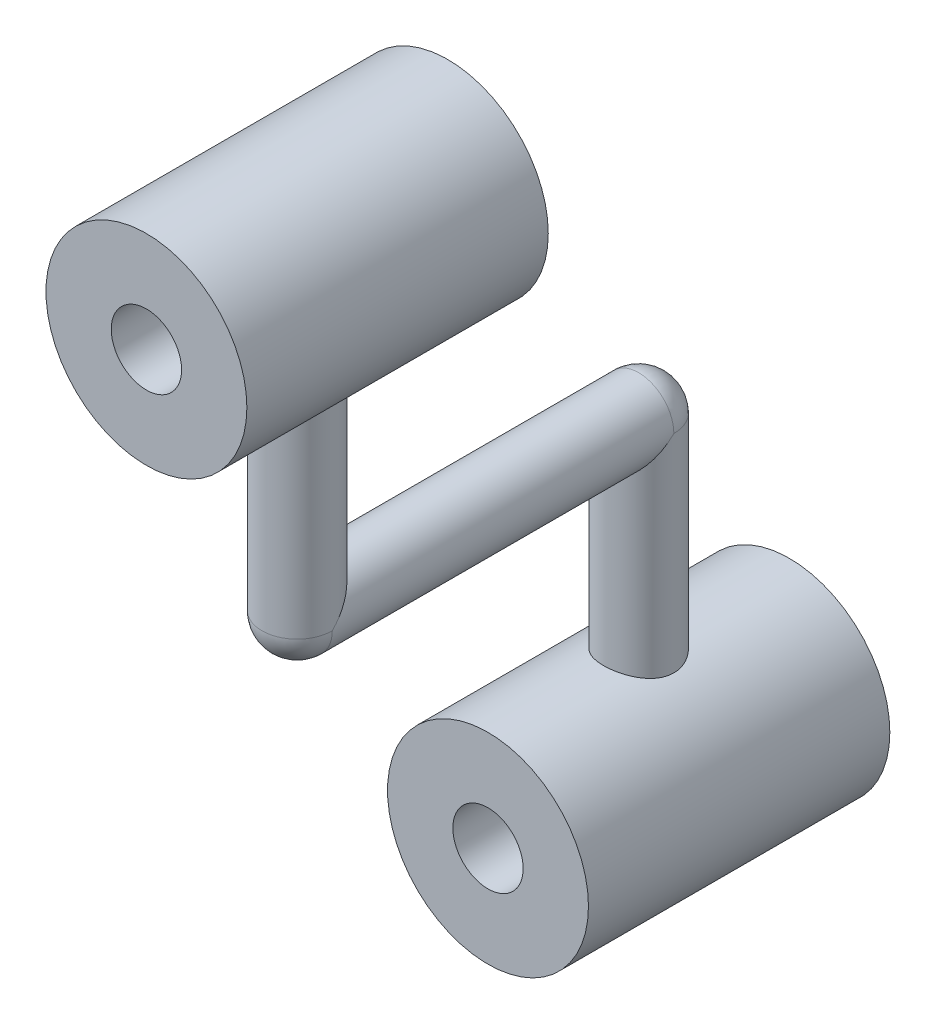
ISO-10303-21;
HEADER;
FILE_DESCRIPTION(('STEP AP214'),'2;1');
FILE_NAME('part.step','',(''),(''),'','','');
FILE_SCHEMA(('AUTOMOTIVE_DESIGN { 1 0 10303 214 1 1 1 1 }'));
ENDSEC;
DATA;
#1=APPLICATION_CONTEXT('core data for automotive mechanical design processes');
#2=APPLICATION_PROTOCOL_DEFINITION('international standard','automotive_design',2000,#1);
#3=PRODUCT_CONTEXT('',#1,'mechanical');
#4=PRODUCT('Part','Part','',(#3));
#5=PRODUCT_RELATED_PRODUCT_CATEGORY('part','',(#4));
#6=PRODUCT_DEFINITION_FORMATION('','',#4);
#7=PRODUCT_DEFINITION_CONTEXT('part definition',#1,'design');
#8=PRODUCT_DEFINITION('design','',#6,#7);
#9=PRODUCT_DEFINITION_SHAPE('','',#8);
#10=(LENGTH_UNIT() NAMED_UNIT(*) SI_UNIT(.MILLI.,.METRE.));
#11=(NAMED_UNIT(*) PLANE_ANGLE_UNIT() SI_UNIT($,.RADIAN.));
#12=(NAMED_UNIT(*) SI_UNIT($,.STERADIAN.) SOLID_ANGLE_UNIT());
#13=UNCERTAINTY_MEASURE_WITH_UNIT(LENGTH_MEASURE(1.E-05),#10,'distance_accuracy_value','');
#14=(GEOMETRIC_REPRESENTATION_CONTEXT(3) GLOBAL_UNCERTAINTY_ASSIGNED_CONTEXT((#13)) GLOBAL_UNIT_ASSIGNED_CONTEXT((#10,
#11,#12)) REPRESENTATION_CONTEXT('',''));
#15=CARTESIAN_POINT('',(0.,0.,0.));
#16=DIRECTION('',(0.,0.,1.));
#17=DIRECTION('',(1.,0.,0.));
#18=AXIS2_PLACEMENT_3D('',#15,#16,#17);
#19=CARTESIAN_POINT('',(0.,30.,34.));
#20=DIRECTION('',(0.,0.,-1.));
#21=DIRECTION('',(-1.,0.,0.));
#22=AXIS2_PLACEMENT_3D('',#19,#20,#21);
#23=CYLINDRICAL_SURFACE('',#22,3.5);
#24=CARTESIAN_POINT('',(0.,30.,0.));
#25=DIRECTION('',(0.,0.,1.));
#26=DIRECTION('',(1.,0.,0.));
#27=AXIS2_PLACEMENT_3D('',#24,#25,#26);
#28=CIRCLE('',#27,3.5);
#29=CARTESIAN_POINT('',(3.5,30.,0.));
#30=VERTEX_POINT('',#29);
#31=CARTESIAN_POINT('',(-3.5,30.,0.));
#32=VERTEX_POINT('',#31);
#33=EDGE_CURVE('E72',#30,#32,#28,.T.);
#34=ORIENTED_EDGE('',*,*,#33,.T.);
#35=CARTESIAN_POINT('',(0.,30.,0.));
#36=DIRECTION('',(0.,-0.707106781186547,-0.707106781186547));
#37=DIRECTION('',(0.,-0.707106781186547,0.707106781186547));
#38=AXIS2_PLACEMENT_3D('',#35,#36,#37);
#39=ELLIPSE('',#38,4.94974746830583,3.5);
#40=EDGE_CURVE('E71',#32,#30,#39,.F.);
#41=ORIENTED_EDGE('',*,*,#40,.T.);
#42=EDGE_LOOP('',(#34,#41));
#43=FACE_BOUND('',#42,.T.);
#44=CARTESIAN_POINT('',(0.,30.,34.));
#45=DIRECTION('',(0.,-0.707106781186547,-0.707106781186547));
#46=DIRECTION('',(0.,0.707106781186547,-0.707106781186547));
#47=AXIS2_PLACEMENT_3D('',#44,#45,#46);
#48=ELLIPSE('',#47,4.94974746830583,3.5);
#49=CARTESIAN_POINT('',(3.5,30.,34.));
#50=VERTEX_POINT('',#49);
#51=CARTESIAN_POINT('',(-3.5,30.,34.));
#52=VERTEX_POINT('',#51);
#53=EDGE_CURVE('E69',#50,#52,#48,.F.);
#54=ORIENTED_EDGE('',*,*,#53,.F.);
#55=CARTESIAN_POINT('',(0.,30.,34.));
#56=DIRECTION('',(0.,0.,1.));
#57=DIRECTION('',(1.,0.,0.));
#58=AXIS2_PLACEMENT_3D('',#55,#56,#57);
#59=CIRCLE('',#58,3.5);
#60=EDGE_CURVE('E68',#52,#50,#59,.T.);
#61=ORIENTED_EDGE('',*,*,#60,.F.);
#62=EDGE_LOOP('',(#54,#61));
#63=FACE_BOUND('',#62,.T.);
#64=ADVANCED_FACE('F32',(#43,#63),#23,.T.);
#65=CARTESIAN_POINT('',(0.,30.,0.));
#66=DIRECTION('',(0.,-1.,0.));
#67=DIRECTION('',(0.,0.,-1.));
#68=AXIS2_PLACEMENT_3D('',#65,#66,#67);
#69=CYLINDRICAL_SURFACE('',#68,3.5);
#70=CARTESIAN_POINT('',(0.,10.,-3.5));
#71=CARTESIAN_POINT('',(-0.190419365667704,10.000002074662,-3.5000029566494));
#72=CARTESIAN_POINT('',(-0.380817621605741,9.99451197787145,-3.48441032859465));
#73=CARTESIAN_POINT('',(-0.755973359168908,9.97315454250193,-3.42266620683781));
#74=CARTESIAN_POINT('',(-0.940730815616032,9.95728715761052,-3.37651457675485));
#75=CARTESIAN_POINT('',(-1.29914235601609,9.91689126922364,-3.25545106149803));
#76=CARTESIAN_POINT('',(-1.47281549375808,9.89237812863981,-3.18059017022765));
#77=CARTESIAN_POINT('',(-1.80513664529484,9.83716899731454,-3.00447488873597));
#78=CARTESIAN_POINT('',(-1.96378123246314,9.80647160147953,-2.90321449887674));
#79=CARTESIAN_POINT('',(-2.26752589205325,9.74080617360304,-2.67317148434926));
#80=CARTESIAN_POINT('',(-2.41198196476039,9.70572841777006,-2.54357008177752));
#81=CARTESIAN_POINT('',(-2.67761185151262,9.6358339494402,-2.26226333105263));
#82=CARTESIAN_POINT('',(-2.79877980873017,9.60101730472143,-2.11055243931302));
#83=CARTESIAN_POINT('',(-3.01822956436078,9.53435354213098,-1.78334535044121));
#84=CARTESIAN_POINT('',(-3.11564633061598,9.50263856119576,-1.60723944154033));
#85=CARTESIAN_POINT('',(-3.27919932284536,9.44745244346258,-1.23985540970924));
#86=CARTESIAN_POINT('',(-3.34534622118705,9.42397849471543,-1.04858248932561));
#87=CARTESIAN_POINT('',(-3.442016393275,9.3890943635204,-0.663656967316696));
#88=CARTESIAN_POINT('',(-3.47375567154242,9.37727382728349,-0.470348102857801));
#89=CARTESIAN_POINT('',(-3.5045119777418,9.36582571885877,-0.0808148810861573));
#90=CARTESIAN_POINT('',(-3.50354037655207,9.36619390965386,0.115408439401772));
#91=CARTESIAN_POINT('',(-3.4698409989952,9.37872426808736,0.494549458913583));
#92=CARTESIAN_POINT('',(-3.43873715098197,9.3902833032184,0.677634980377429));
#93=CARTESIAN_POINT('',(-3.34831908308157,9.42290004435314,1.03580240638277));
#94=CARTESIAN_POINT('',(-3.28900115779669,9.44395899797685,1.21088325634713));
#95=CARTESIAN_POINT('',(-3.14284371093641,9.49360610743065,1.55161236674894));
#96=CARTESIAN_POINT('',(-3.05554665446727,9.52231799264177,1.71704555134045));
#97=CARTESIAN_POINT('',(-2.85622688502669,9.58398812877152,2.03141194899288));
#98=CARTESIAN_POINT('',(-2.74419646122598,9.61694770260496,2.18033999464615));
#99=CARTESIAN_POINT('',(-2.49093399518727,9.68573241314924,2.46654322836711));
#100=CARTESIAN_POINT('',(-2.34838607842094,9.72161293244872,2.60264324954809));
#101=CARTESIAN_POINT('',(-2.04205684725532,9.79053740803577,2.84932987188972));
#102=CARTESIAN_POINT('',(-1.87827306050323,9.8235810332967,2.95991349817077));
#103=CARTESIAN_POINT('',(-1.53143472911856,9.88362313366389,3.15350599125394));
#104=CARTESIAN_POINT('',(-1.34817380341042,9.91054487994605,3.2361705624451));
#105=CARTESIAN_POINT('',(-0.969175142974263,9.95474882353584,3.36912230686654));
#106=CARTESIAN_POINT('',(-0.773442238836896,9.97203472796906,3.41942193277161));
#107=CARTESIAN_POINT('',(-0.38498204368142,9.9943906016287,3.48406581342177));
#108=CARTESIAN_POINT('',(-0.192549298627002,9.9999988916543,3.49999580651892));
#109=CARTESIAN_POINT('',(0.192296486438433,10.0000011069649,3.50000418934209));
#110=CARTESIAN_POINT('',(0.384709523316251,9.9943971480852,3.48408858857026));
#111=CARTESIAN_POINT('',(0.757512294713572,9.97296032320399,3.42209465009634));
#112=CARTESIAN_POINT('',(0.938089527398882,9.95746630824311,3.37701486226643));
#113=CARTESIAN_POINT('',(1.28902504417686,9.91814590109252,3.25924618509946));
#114=CARTESIAN_POINT('',(1.45938200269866,9.89431843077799,3.18655372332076));
#115=CARTESIAN_POINT('',(1.790306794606,9.83990425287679,3.01340991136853));
#116=CARTESIAN_POINT('',(1.95047324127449,9.80914873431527,2.91224601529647));
#117=CARTESIAN_POINT('',(2.25205778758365,9.74433517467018,2.68585482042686));
#118=CARTESIAN_POINT('',(2.39346963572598,9.71027603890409,2.56061953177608));
#119=CARTESIAN_POINT('',(2.66095315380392,9.64050839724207,2.28219979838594));
#120=CARTESIAN_POINT('',(2.78589451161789,9.60480315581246,2.12792589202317));
#121=CARTESIAN_POINT('',(3.00828742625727,9.53749178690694,1.79985410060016));
#122=CARTESIAN_POINT('',(3.10573801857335,9.50588580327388,1.62605553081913));
#123=CARTESIAN_POINT('',(3.27010981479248,9.45060554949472,1.26333270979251));
#124=CARTESIAN_POINT('',(3.33703039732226,9.42693144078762,1.07440815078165));
#125=CARTESIAN_POINT('',(3.43775166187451,9.39067542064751,0.686934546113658));
#126=CARTESIAN_POINT('',(3.47156933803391,9.37808781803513,0.488390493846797));
#127=CARTESIAN_POINT('',(3.50371939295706,9.36612061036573,0.0993796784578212));
#128=CARTESIAN_POINT('',(3.50394730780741,9.36603546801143,-0.0909102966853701));
#129=CARTESIAN_POINT('',(3.47365100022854,9.37731326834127,-0.4686626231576));
#130=CARTESIAN_POINT('',(3.44312898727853,9.38867538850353,-0.656125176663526));
#131=CARTESIAN_POINT('',(3.35359653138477,9.42101694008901,-1.01855095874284));
#132=CARTESIAN_POINT('',(3.29526105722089,9.44176794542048,-1.19370296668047));
#133=CARTESIAN_POINT('',(3.15232119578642,9.49044489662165,-1.53185809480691));
#134=CARTESIAN_POINT('',(3.06771062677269,9.51837253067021,-1.69485834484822));
#135=CARTESIAN_POINT('',(2.86997020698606,9.57989875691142,-2.0124345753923));
#136=CARTESIAN_POINT('',(2.75568240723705,9.61370284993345,-2.16624940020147));
#137=CARTESIAN_POINT('',(2.50372401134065,9.68237561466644,-2.45312762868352));
#138=CARTESIAN_POINT('',(2.36604648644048,9.71724459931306,-2.58618486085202));
#139=CARTESIAN_POINT('',(2.06385316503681,9.78598669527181,-2.83378378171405));
#140=CARTESIAN_POINT('',(1.89841397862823,9.81974595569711,-2.94723445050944));
#141=CARTESIAN_POINT('',(1.54966762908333,9.8807802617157,-3.14462349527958));
#142=CARTESIAN_POINT('',(1.36636283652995,9.90805616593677,-3.22856577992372));
#143=CARTESIAN_POINT('',(0.989029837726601,9.95276281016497,-3.36325721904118));
#144=CARTESIAN_POINT('',(0.79513954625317,9.97029715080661,-3.41435660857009));
#145=CARTESIAN_POINT('',(0.400823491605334,9.9939126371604,-3.48272048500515));
#146=CARTESIAN_POINT('',(0.20040005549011,9.9999978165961,-3.49999688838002));
#147=CARTESIAN_POINT('',(0.,10.,-3.5));
#148=B_SPLINE_CURVE_WITH_KNOTS('',3,(#70,#71,#72,#73,#74,#75,#76,#77,#78,#79,#80,#81,#82,#83,
#84,#85,#86,#87,#88,#89,#90,#91,#92,#93,#94,#95,#96,#97,#98,#99,#100,#101,#102,#103,#104,#105,
#106,#107,#108,#109,#110,#111,#112,#113,#114,#115,#116,#117,#118,#119,#120,#121,#122,#123,#124,
#125,#126,#127,#128,#129,#130,#131,#132,#133,#134,#135,#136,#137,#138,#139,#140,#141,#142,#143,
#144,#145,#146,#147),.UNSPECIFIED.,.T.,.F.,(4,2,2,2,2,2,2,2,2,2,2,2,2,2,2,2,2,2,2,2,2,2,2,2,2,2,
2,2,2,2,2,2,2,2,2,2,2,2,4),(0.,0.570519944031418,1.14104243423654,1.71055621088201,
2.28019953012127,2.86921290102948,3.45837421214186,4.06655384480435,4.67452575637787,
5.26023033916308,5.84573132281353,6.40133800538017,6.95701767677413,7.52229238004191,
8.08774356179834,8.68595781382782,9.28424177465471,9.88965514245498,10.4948354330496,
11.0714375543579,11.6479308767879,12.2056613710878,12.7634640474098,13.336703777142,
13.9101341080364,14.5124257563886,15.1147385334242,15.7170635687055,16.319079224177,
16.8871081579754,17.4550962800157,18.0099524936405,18.5649393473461,19.1461307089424,
19.7274945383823,20.3347978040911,20.9420205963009,21.5426555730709,22.143078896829),.UNSPECIFIED.);
#149=CARTESIAN_POINT('',(0.,10.,-3.5));
#150=VERTEX_POINT('',#149);
#151=EDGE_CURVE('E11',#150,#150,#148,.T.);
#152=ORIENTED_EDGE('',*,*,#151,.T.);
#153=EDGE_LOOP('',(#152));
#154=FACE_BOUND('',#153,.T.);
#155=ORIENTED_EDGE('',*,*,#40,.F.);
#156=CARTESIAN_POINT('',(0.,30.,0.));
#157=DIRECTION('',(0.,1.,0.));
#158=DIRECTION('',(0.,0.,1.));
#159=AXIS2_PLACEMENT_3D('',#156,#157,#158);
#160=CIRCLE('',#159,3.5);
#161=EDGE_CURVE('E53',#30,#32,#160,.T.);
#162=ORIENTED_EDGE('',*,*,#161,.F.);
#163=EDGE_LOOP('',(#155,#162));
#164=FACE_BOUND('',#163,.T.);
#165=ADVANCED_FACE('F92',(#154,#164),#69,.T.);
#166=CARTESIAN_POINT('',(0.,0.,15.));
#167=DIRECTION('',(0.,0.,-1.));
#168=DIRECTION('',(-1.,0.,0.));
#169=AXIS2_PLACEMENT_3D('',#166,#167,#168);
#170=CYLINDRICAL_SURFACE('',#169,10.);
#171=CARTESIAN_POINT('',(0.,0.,-15.));
#172=DIRECTION('',(0.,0.,1.));
#173=DIRECTION('',(1.,0.,0.));
#174=AXIS2_PLACEMENT_3D('',#171,#172,#173);
#175=CIRCLE('',#174,10.);
#176=CARTESIAN_POINT('',(10.,0.,-15.));
#177=VERTEX_POINT('',#176);
#178=EDGE_CURVE('E226',#177,#177,#175,.T.);
#179=ORIENTED_EDGE('',*,*,#178,.T.);
#180=EDGE_LOOP('',(#179));
#181=FACE_BOUND('',#180,.T.);
#182=CARTESIAN_POINT('',(0.,0.,15.));
#183=DIRECTION('',(0.,0.,1.));
#184=DIRECTION('',(1.,0.,0.));
#185=AXIS2_PLACEMENT_3D('',#182,#183,#184);
#186=CIRCLE('',#185,10.);
#187=CARTESIAN_POINT('',(10.,0.,15.));
#188=VERTEX_POINT('',#187);
#189=EDGE_CURVE('E46',#188,#188,#186,.T.);
#190=ORIENTED_EDGE('',*,*,#189,.F.);
#191=EDGE_LOOP('',(#190));
#192=FACE_BOUND('',#191,.T.);
#193=ORIENTED_EDGE('',*,*,#151,.F.);
#194=EDGE_LOOP('',(#193));
#195=FACE_BOUND('',#194,.T.);
#196=ADVANCED_FACE('F34',(#181,#192,#195),#170,.T.);
#197=CARTESIAN_POINT('',(0.,0.,15.));
#198=DIRECTION('',(0.,0.,-1.));
#199=DIRECTION('',(-1.,0.,0.));
#200=AXIS2_PLACEMENT_3D('',#197,#198,#199);
#201=CYLINDRICAL_SURFACE('',#200,3.5);
#202=CARTESIAN_POINT('',(0.,0.,-15.));
#203=DIRECTION('',(0.,0.,1.));
#204=DIRECTION('',(1.,0.,0.));
#205=AXIS2_PLACEMENT_3D('',#202,#203,#204);
#206=CIRCLE('',#205,3.5);
#207=CARTESIAN_POINT('',(3.5,0.,-15.));
#208=VERTEX_POINT('',#207);
#209=EDGE_CURVE('E86',#208,#208,#206,.T.);
#210=ORIENTED_EDGE('',*,*,#209,.F.);
#211=EDGE_LOOP('',(#210));
#212=FACE_BOUND('',#211,.T.);
#213=CARTESIAN_POINT('',(0.,0.,15.));
#214=DIRECTION('',(0.,0.,1.));
#215=DIRECTION('',(1.,0.,0.));
#216=AXIS2_PLACEMENT_3D('',#213,#214,#215);
#217=CIRCLE('',#216,3.5);
#218=CARTESIAN_POINT('',(3.5,0.,15.));
#219=VERTEX_POINT('',#218);
#220=EDGE_CURVE('E230',#219,#219,#217,.T.);
#221=ORIENTED_EDGE('',*,*,#220,.T.);
#222=EDGE_LOOP('',(#221));
#223=FACE_BOUND('',#222,.T.);
#224=ADVANCED_FACE('F103',(#212,#223),#201,.F.);
#225=CARTESIAN_POINT('',(0.,0.,15.));
#226=DIRECTION('',(0.,0.,1.));
#227=DIRECTION('',(1.,0.,0.));
#228=AXIS2_PLACEMENT_3D('',#225,#226,#227);
#229=PLANE('',#228);
#230=ORIENTED_EDGE('',*,*,#189,.T.);
#231=EDGE_LOOP('',(#230));
#232=FACE_BOUND('',#231,.T.);
#233=ORIENTED_EDGE('',*,*,#220,.F.);
#234=EDGE_LOOP('',(#233));
#235=FACE_BOUND('',#234,.T.);
#236=ADVANCED_FACE('F101',(#232,#235),#229,.T.);
#237=CARTESIAN_POINT('',(0.,0.,-15.));
#238=DIRECTION('',(0.,0.,1.));
#239=DIRECTION('',(1.,0.,0.));
#240=AXIS2_PLACEMENT_3D('',#237,#238,#239);
#241=PLANE('',#240);
#242=ORIENTED_EDGE('',*,*,#209,.T.);
#243=EDGE_LOOP('',(#242));
#244=FACE_BOUND('',#243,.T.);
#245=ORIENTED_EDGE('',*,*,#178,.F.);
#246=EDGE_LOOP('',(#245));
#247=FACE_BOUND('',#246,.T.);
#248=ADVANCED_FACE('F98',(#244,#247),#241,.F.);
#249=CARTESIAN_POINT('',(0.,26.5,34.));
#250=DIRECTION('',(0.,-1.,0.));
#251=DIRECTION('',(0.,0.,-1.));
#252=AXIS2_PLACEMENT_3D('',#249,#250,#251);
#253=CYLINDRICAL_SURFACE('',#252,3.5);
#254=CARTESIAN_POINT('',(0.,50.,30.5));
#255=CARTESIAN_POINT('',(0.190419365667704,49.999997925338,30.4999970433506));
#256=CARTESIAN_POINT('',(0.380817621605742,50.0054880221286,30.5155896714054));
#257=CARTESIAN_POINT('',(0.75597335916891,50.0268454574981,30.5773337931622));
#258=CARTESIAN_POINT('',(0.940730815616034,50.0427128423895,30.6234854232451));
#259=CARTESIAN_POINT('',(1.29914235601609,50.0831087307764,30.744548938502));
#260=CARTESIAN_POINT('',(1.47281549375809,50.1076218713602,30.8194098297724));
#261=CARTESIAN_POINT('',(1.80513664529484,50.1628310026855,30.995525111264));
#262=CARTESIAN_POINT('',(1.96378123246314,50.1935283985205,31.0967855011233));
#263=CARTESIAN_POINT('',(2.26752589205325,50.259193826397,31.3268285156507));
#264=CARTESIAN_POINT('',(2.41198196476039,50.2942715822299,31.4564299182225));
#265=CARTESIAN_POINT('',(2.67761185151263,50.3641660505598,31.7377366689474));
#266=CARTESIAN_POINT('',(2.79877980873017,50.3989826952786,31.889447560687));
#267=CARTESIAN_POINT('',(3.01822956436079,50.465646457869,32.2166546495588));
#268=CARTESIAN_POINT('',(3.11564633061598,50.4973614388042,32.3927605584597));
#269=CARTESIAN_POINT('',(3.27919932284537,50.5525475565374,32.7601445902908));
#270=CARTESIAN_POINT('',(3.34534622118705,50.5760215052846,32.9514175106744));
#271=CARTESIAN_POINT('',(3.442016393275,50.6109056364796,33.3363430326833));
#272=CARTESIAN_POINT('',(3.47375567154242,50.6227261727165,33.5296518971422));
#273=CARTESIAN_POINT('',(3.5045119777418,50.6341742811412,33.9191851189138));
#274=CARTESIAN_POINT('',(3.50354037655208,50.6338060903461,34.1154084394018));
#275=CARTESIAN_POINT('',(3.46984099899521,50.6212757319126,34.4945494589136));
#276=CARTESIAN_POINT('',(3.43873715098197,50.6097166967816,34.6776349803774));
#277=CARTESIAN_POINT('',(3.34831908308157,50.5770999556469,35.0358024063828));
#278=CARTESIAN_POINT('',(3.2890011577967,50.5560410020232,35.2108832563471));
#279=CARTESIAN_POINT('',(3.14284371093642,50.5063938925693,35.5516123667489));
#280=CARTESIAN_POINT('',(3.05554665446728,50.4776820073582,35.7170455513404));
#281=CARTESIAN_POINT('',(2.8562268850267,50.4160118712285,36.0314119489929));
#282=CARTESIAN_POINT('',(2.74419646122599,50.383052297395,36.1803399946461));
#283=CARTESIAN_POINT('',(2.49093399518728,50.3142675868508,36.4665432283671));
#284=CARTESIAN_POINT('',(2.34838607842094,50.2783870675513,36.6026432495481));
#285=CARTESIAN_POINT('',(2.04205684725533,50.2094625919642,36.8493298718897));
#286=CARTESIAN_POINT('',(1.87827306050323,50.1764189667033,36.9599134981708));
#287=CARTESIAN_POINT('',(1.53143472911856,50.1163768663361,37.1535059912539));
#288=CARTESIAN_POINT('',(1.34817380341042,50.0894551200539,37.2361705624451));
#289=CARTESIAN_POINT('',(0.969175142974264,50.0452511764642,37.3691223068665));
#290=CARTESIAN_POINT('',(0.773442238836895,50.0279652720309,37.4194219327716));
#291=CARTESIAN_POINT('',(0.384982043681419,50.0056093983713,37.4840658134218));
#292=CARTESIAN_POINT('',(0.192549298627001,50.0000011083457,37.4999958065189));
#293=CARTESIAN_POINT('',(-0.192296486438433,49.9999988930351,37.5000041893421));
#294=CARTESIAN_POINT('',(-0.38470952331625,50.0056028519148,37.4840885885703));
#295=CARTESIAN_POINT('',(-0.757512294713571,50.027039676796,37.4220946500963));
#296=CARTESIAN_POINT('',(-0.938089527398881,50.0425336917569,37.3770148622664));
#297=CARTESIAN_POINT('',(-1.28902504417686,50.0818540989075,37.2592461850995));
#298=CARTESIAN_POINT('',(-1.45938200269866,50.105681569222,37.1865537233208));
#299=CARTESIAN_POINT('',(-1.790306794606,50.1600957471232,37.0134099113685));
#300=CARTESIAN_POINT('',(-1.95047324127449,50.1908512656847,36.9122460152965));
#301=CARTESIAN_POINT('',(-2.25205778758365,50.2556648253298,36.6858548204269));
#302=CARTESIAN_POINT('',(-2.39346963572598,50.2897239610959,36.5606195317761));
#303=CARTESIAN_POINT('',(-2.66095315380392,50.3594916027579,36.2821997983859));
#304=CARTESIAN_POINT('',(-2.7858945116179,50.3951968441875,36.1279258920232));
#305=CARTESIAN_POINT('',(-3.00828742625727,50.4625082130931,35.7998541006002));
#306=CARTESIAN_POINT('',(-3.10573801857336,50.4941141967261,35.6260555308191));
#307=CARTESIAN_POINT('',(-3.27010981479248,50.5493944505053,35.2633327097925));
#308=CARTESIAN_POINT('',(-3.33703039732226,50.5730685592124,35.0744081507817));
#309=CARTESIAN_POINT('',(-3.43775166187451,50.6093245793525,34.6869345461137));
#310=CARTESIAN_POINT('',(-3.47156933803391,50.6219121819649,34.4883904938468));
#311=CARTESIAN_POINT('',(-3.50371939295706,50.6338793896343,34.0993796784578));
#312=CARTESIAN_POINT('',(-3.50394730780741,50.6339645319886,33.9090897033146));
#313=CARTESIAN_POINT('',(-3.47365100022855,50.6226867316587,33.5313373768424));
#314=CARTESIAN_POINT('',(-3.44312898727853,50.6113246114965,33.3438748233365));
#315=CARTESIAN_POINT('',(-3.35359653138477,50.578983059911,32.9814490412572));
#316=CARTESIAN_POINT('',(-3.29526105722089,50.5582320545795,32.8062970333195));
#317=CARTESIAN_POINT('',(-3.15232119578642,50.5095551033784,32.4681419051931));
#318=CARTESIAN_POINT('',(-3.06771062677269,50.4816274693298,32.3051416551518));
#319=CARTESIAN_POINT('',(-2.86997020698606,50.4201012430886,31.9875654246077));
#320=CARTESIAN_POINT('',(-2.75568240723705,50.3862971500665,31.8337505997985));
#321=CARTESIAN_POINT('',(-2.50372401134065,50.3176243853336,31.5468723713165));
#322=CARTESIAN_POINT('',(-2.36604648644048,50.2827554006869,31.413815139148));
#323=CARTESIAN_POINT('',(-2.06385316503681,50.2140133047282,31.1662162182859));
#324=CARTESIAN_POINT('',(-1.89841397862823,50.1802540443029,31.0527655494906));
#325=CARTESIAN_POINT('',(-1.54966762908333,50.1192197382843,30.8553765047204));
#326=CARTESIAN_POINT('',(-1.36636283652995,50.0919438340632,30.7714342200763));
#327=CARTESIAN_POINT('',(-0.9890298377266,50.047237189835,30.6367427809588));
#328=CARTESIAN_POINT('',(-0.795139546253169,50.0297028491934,30.5856433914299));
#329=CARTESIAN_POINT('',(-0.400823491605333,50.0060873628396,30.5172795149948));
#330=CARTESIAN_POINT('',(-0.20040005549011,50.0000021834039,30.50000311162));
#331=CARTESIAN_POINT('',(0.,50.,30.5));
#332=B_SPLINE_CURVE_WITH_KNOTS('',3,(#254,#255,#256,#257,#258,#259,#260,#261,#262,#263,#264,
#265,#266,#267,#268,#269,#270,#271,#272,#273,#274,#275,#276,#277,#278,#279,#280,#281,#282,#283,
#284,#285,#286,#287,#288,#289,#290,#291,#292,#293,#294,#295,#296,#297,#298,#299,#300,#301,#302,
#303,#304,#305,#306,#307,#308,#309,#310,#311,#312,#313,#314,#315,#316,#317,#318,#319,#320,#321,
#322,#323,#324,#325,#326,#327,#328,#329,#330,#331),.UNSPECIFIED.,.T.,.F.,(4,2,2,2,2,2,2,2,2,2,2,
2,2,2,2,2,2,2,2,2,2,2,2,2,2,2,2,2,2,2,2,2,2,2,2,2,2,2,4),(0.,0.57051994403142,1.14104243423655,
1.71055621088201,2.28019953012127,2.86921290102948,3.45837421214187,4.06655384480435,
4.67452575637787,5.26023033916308,5.84573132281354,6.40133800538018,6.95701767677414,
7.52229238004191,8.08774356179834,8.68595781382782,9.28424177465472,9.88965514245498,
10.4948354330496,11.0714375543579,11.6479308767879,12.2056613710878,12.7634640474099,
13.336703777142,13.9101341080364,14.5124257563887,15.1147385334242,15.7170635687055,
16.319079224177,16.8871081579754,17.4550962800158,18.0099524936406,18.5649393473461,
19.1461307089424,19.7274945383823,20.3347978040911,20.942020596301,21.542655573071,
22.1430788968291),.UNSPECIFIED.);
#333=CARTESIAN_POINT('',(0.,50.,30.5));
#334=VERTEX_POINT('',#333);
#335=EDGE_CURVE('E37',#334,#334,#332,.T.);
#336=ORIENTED_EDGE('',*,*,#335,.T.);
#337=EDGE_LOOP('',(#336));
#338=FACE_BOUND('',#337,.T.);
#339=CARTESIAN_POINT('',(0.,30.,34.));
#340=DIRECTION('',(0.,-1.,0.));
#341=DIRECTION('',(0.,0.,-1.));
#342=AXIS2_PLACEMENT_3D('',#339,#340,#341);
#343=CIRCLE('',#342,3.5);
#344=EDGE_CURVE('E60',#50,#52,#343,.T.);
#345=ORIENTED_EDGE('',*,*,#344,.F.);
#346=ORIENTED_EDGE('',*,*,#53,.T.);
#347=EDGE_LOOP('',(#345,#346));
#348=FACE_BOUND('',#347,.T.);
#349=ADVANCED_FACE('F74',(#338,#348),#253,.T.);
#350=CARTESIAN_POINT('',(0.,60.,64.4070213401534));
#351=DIRECTION('',(0.,0.,1.));
#352=DIRECTION('',(1.,0.,0.));
#353=AXIS2_PLACEMENT_3D('',#350,#351,#352);
#354=CYLINDRICAL_SURFACE('',#353,10.);
#355=CARTESIAN_POINT('',(0.,60.,49.));
#356=DIRECTION('',(0.,0.,1.));
#357=DIRECTION('',(1.,0.,0.));
#358=AXIS2_PLACEMENT_3D('',#355,#356,#357);
#359=CIRCLE('',#358,10.);
#360=CARTESIAN_POINT('',(10.,60.,49.));
#361=VERTEX_POINT('',#360);
#362=EDGE_CURVE('E79',#361,#361,#359,.T.);
#363=ORIENTED_EDGE('',*,*,#362,.F.);
#364=EDGE_LOOP('',(#363));
#365=FACE_BOUND('',#364,.T.);
#366=CARTESIAN_POINT('',(0.,60.,19.));
#367=DIRECTION('',(0.,0.,1.));
#368=DIRECTION('',(1.,0.,0.));
#369=AXIS2_PLACEMENT_3D('',#366,#367,#368);
#370=CIRCLE('',#369,10.);
#371=CARTESIAN_POINT('',(10.,60.,19.));
#372=VERTEX_POINT('',#371);
#373=EDGE_CURVE('E244',#372,#372,#370,.T.);
#374=ORIENTED_EDGE('',*,*,#373,.T.);
#375=EDGE_LOOP('',(#374));
#376=FACE_BOUND('',#375,.T.);
#377=ORIENTED_EDGE('',*,*,#335,.F.);
#378=EDGE_LOOP('',(#377));
#379=FACE_BOUND('',#378,.T.);
#380=ADVANCED_FACE('F134',(#365,#376,#379),#354,.T.);
#381=CARTESIAN_POINT('',(0.,60.,49.));
#382=DIRECTION('',(0.,0.,1.));
#383=DIRECTION('',(1.,0.,0.));
#384=AXIS2_PLACEMENT_3D('',#381,#382,#383);
#385=PLANE('',#384);
#386=CARTESIAN_POINT('',(0.,60.,49.));
#387=DIRECTION('',(0.,0.,1.));
#388=DIRECTION('',(1.,0.,0.));
#389=AXIS2_PLACEMENT_3D('',#386,#387,#388);
#390=CIRCLE('',#389,3.5);
#391=CARTESIAN_POINT('',(3.5,60.,49.));
#392=VERTEX_POINT('',#391);
#393=EDGE_CURVE('E241',#392,#392,#390,.T.);
#394=ORIENTED_EDGE('',*,*,#393,.F.);
#395=EDGE_LOOP('',(#394));
#396=FACE_BOUND('',#395,.T.);
#397=ORIENTED_EDGE('',*,*,#362,.T.);
#398=EDGE_LOOP('',(#397));
#399=FACE_BOUND('',#398,.T.);
#400=ADVANCED_FACE('F132',(#396,#399),#385,.T.);
#401=CARTESIAN_POINT('',(0.,60.,19.));
#402=DIRECTION('',(0.,0.,-1.));
#403=DIRECTION('',(-1.,0.,0.));
#404=AXIS2_PLACEMENT_3D('',#401,#402,#403);
#405=PLANE('',#404);
#406=CARTESIAN_POINT('',(0.,60.,19.));
#407=DIRECTION('',(0.,0.,-1.));
#408=DIRECTION('',(-1.,0.,0.));
#409=AXIS2_PLACEMENT_3D('',#406,#407,#408);
#410=CIRCLE('',#409,3.5);
#411=CARTESIAN_POINT('',(-3.5,60.,19.));
#412=VERTEX_POINT('',#411);
#413=EDGE_CURVE('E248',#412,#412,#410,.T.);
#414=ORIENTED_EDGE('',*,*,#413,.F.);
#415=EDGE_LOOP('',(#414));
#416=FACE_BOUND('',#415,.T.);
#417=ORIENTED_EDGE('',*,*,#373,.F.);
#418=EDGE_LOOP('',(#417));
#419=FACE_BOUND('',#418,.T.);
#420=ADVANCED_FACE('F127',(#416,#419),#405,.T.);
#421=CARTESIAN_POINT('',(0.,60.,54.));
#422=DIRECTION('',(0.,0.,-1.));
#423=DIRECTION('',(-1.,0.,0.));
#424=AXIS2_PLACEMENT_3D('',#421,#422,#423);
#425=CYLINDRICAL_SURFACE('',#424,3.5);
#426=ORIENTED_EDGE('',*,*,#393,.T.);
#427=EDGE_LOOP('',(#426));
#428=FACE_BOUND('',#427,.T.);
#429=ORIENTED_EDGE('',*,*,#413,.T.);
#430=EDGE_LOOP('',(#429));
#431=FACE_BOUND('',#430,.T.);
#432=ADVANCED_FACE('F120',(#428,#431),#425,.F.);
#433=CARTESIAN_POINT('',(0.,30.,0.));
#434=DIRECTION('',(1.,0.,0.));
#435=DIRECTION('',(0.,1.,0.));
#436=AXIS2_PLACEMENT_3D('',#433,#434,#435);
#437=SPHERICAL_SURFACE('',#436,3.5);
#438=ORIENTED_EDGE('',*,*,#161,.T.);
#439=ORIENTED_EDGE('',*,*,#33,.F.);
#440=EDGE_LOOP('',(#438,#439));
#441=FACE_BOUND('',#440,.T.);
#442=ADVANCED_FACE('F118',(#441),#437,.T.);
#443=CARTESIAN_POINT('',(0.,30.,34.));
#444=DIRECTION('',(-1.,0.,0.));
#445=DIRECTION('',(0.,1.,0.));
#446=AXIS2_PLACEMENT_3D('',#443,#444,#445);
#447=SPHERICAL_SURFACE('',#446,3.5);
#448=ORIENTED_EDGE('',*,*,#344,.T.);
#449=ORIENTED_EDGE('',*,*,#60,.T.);
#450=EDGE_LOOP('',(#448,#449));
#451=FACE_BOUND('',#450,.T.);
#452=ADVANCED_FACE('F76',(#451),#447,.T.);
#453=CLOSED_SHELL('',(#64,#165,#196,#224,#236,#248,#349,#380,#400,#420,#432,#442,#452));
#454=MANIFOLD_SOLID_BREP('B2',#453);
#455=ADVANCED_BREP_SHAPE_REPRESENTATION('',(#18,#454),#14);
#456=SHAPE_DEFINITION_REPRESENTATION(#9,#455);
ENDSEC;
END-ISO-10303-21;
